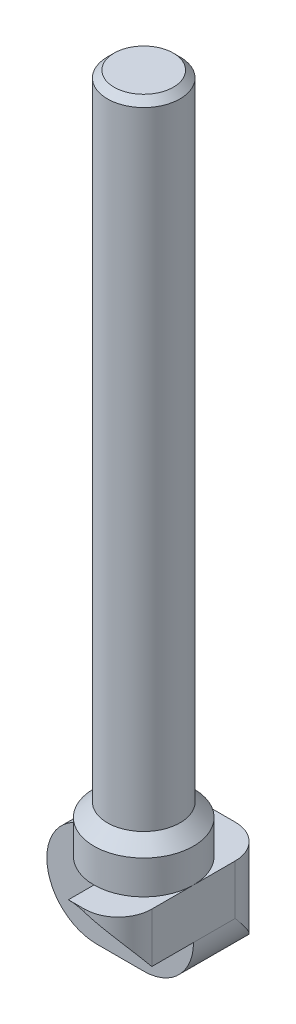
ISO-10303-21;
HEADER;
FILE_DESCRIPTION(('STEP AP214'),'2;1');
FILE_NAME('part.step','',(''),(''),'','','');
FILE_SCHEMA(('AUTOMOTIVE_DESIGN { 1 0 10303 214 1 1 1 1 }'));
ENDSEC;
DATA;
#1=APPLICATION_CONTEXT('core data for automotive mechanical design processes');
#2=APPLICATION_PROTOCOL_DEFINITION('international standard','automotive_design',2000,#1);
#3=PRODUCT_CONTEXT('',#1,'mechanical');
#4=PRODUCT('Part','Part','',(#3));
#5=PRODUCT_RELATED_PRODUCT_CATEGORY('part','',(#4));
#6=PRODUCT_DEFINITION_FORMATION('','',#4);
#7=PRODUCT_DEFINITION_CONTEXT('part definition',#1,'design');
#8=PRODUCT_DEFINITION('design','',#6,#7);
#9=PRODUCT_DEFINITION_SHAPE('','',#8);
#10=(LENGTH_UNIT() NAMED_UNIT(*) SI_UNIT(.MILLI.,.METRE.));
#11=(NAMED_UNIT(*) PLANE_ANGLE_UNIT() SI_UNIT($,.RADIAN.));
#12=(NAMED_UNIT(*) SI_UNIT($,.STERADIAN.) SOLID_ANGLE_UNIT());
#13=UNCERTAINTY_MEASURE_WITH_UNIT(LENGTH_MEASURE(1.E-05),#10,'distance_accuracy_value','');
#14=(GEOMETRIC_REPRESENTATION_CONTEXT(3) GLOBAL_UNCERTAINTY_ASSIGNED_CONTEXT((#13)) GLOBAL_UNIT_ASSIGNED_CONTEXT((#10,
#11,#12)) REPRESENTATION_CONTEXT('',''));
#15=CARTESIAN_POINT('',(0.,0.,0.));
#16=DIRECTION('',(0.,0.,1.));
#17=DIRECTION('',(1.,0.,0.));
#18=AXIS2_PLACEMENT_3D('',#15,#16,#17);
#19=CARTESIAN_POINT('',(-35.,-590.,-56.));
#20=DIRECTION('',(0.,0.,1.));
#21=DIRECTION('',(1.,0.,0.));
#22=AXIS2_PLACEMENT_3D('',#19,#20,#21);
#23=PLANE('',#22);
#24=DIRECTION('',(-1.,0.,0.));
#25=VECTOR('',#24,1.);
#26=CARTESIAN_POINT('',(37.0000000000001,-553.,-56.));
#27=LINE('',#26,#25);
#28=CARTESIAN_POINT('',(12.0000000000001,-553.,-56.));
#29=VERTEX_POINT('',#28);
#30=CARTESIAN_POINT('',(-35.,-553.,-56.));
#31=VERTEX_POINT('',#30);
#32=EDGE_CURVE('E258',#29,#31,#27,.T.);
#33=ORIENTED_EDGE('',*,*,#32,.F.);
#34=DIRECTION('',(0.,1.,0.));
#35=VECTOR('',#34,1.);
#36=CARTESIAN_POINT('',(12.0000000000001,-590.,-56.));
#37=LINE('',#36,#35);
#38=CARTESIAN_POINT('',(12.0000000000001,-625.,-56.));
#39=VERTEX_POINT('',#38);
#40=EDGE_CURVE('E55',#29,#39,#37,.F.);
#41=ORIENTED_EDGE('',*,*,#40,.T.);
#42=CARTESIAN_POINT('',(0.,-590.,-56.));
#43=DIRECTION('',(0.,0.,1.));
#44=DIRECTION('',(1.,0.,0.));
#45=AXIS2_PLACEMENT_3D('',#42,#43,#44);
#46=CIRCLE('',#45,37.);
#47=CARTESIAN_POINT('',(0.,-627.,-56.));
#48=VERTEX_POINT('',#47);
#49=EDGE_CURVE('E269',#48,#39,#46,.T.);
#50=ORIENTED_EDGE('',*,*,#49,.F.);
#51=DIRECTION('',(1.,0.,0.));
#52=VECTOR('',#51,1.);
#53=CARTESIAN_POINT('',(-35.,-627.,-56.));
#54=LINE('',#53,#52);
#55=CARTESIAN_POINT('',(-35.,-627.,-56.));
#56=VERTEX_POINT('',#55);
#57=EDGE_CURVE('E429',#56,#48,#54,.T.);
#58=ORIENTED_EDGE('',*,*,#57,.F.);
#59=CARTESIAN_POINT('',(-35.,-590.,-56.));
#60=DIRECTION('',(0.,0.,1.));
#61=DIRECTION('',(1.,0.,0.));
#62=AXIS2_PLACEMENT_3D('',#59,#60,#61);
#63=CIRCLE('',#62,37.);
#64=EDGE_CURVE('E137',#31,#56,#63,.T.);
#65=ORIENTED_EDGE('',*,*,#64,.F.);
#66=EDGE_LOOP('',(#33,#41,#50,#58,#65));
#67=FACE_BOUND('',#66,.T.);
#68=CARTESIAN_POINT('',(-35.,-590.,-56.));
#69=DIRECTION('',(0.,0.,1.));
#70=DIRECTION('',(1.,0.,0.));
#71=AXIS2_PLACEMENT_3D('',#68,#69,#70);
#72=CIRCLE('',#71,35.);
#73=CARTESIAN_POINT('',(0.,-590.,-56.));
#74=VERTEX_POINT('',#73);
#75=EDGE_CURVE('E11',#74,#74,#72,.F.);
#76=ORIENTED_EDGE('',*,*,#75,.F.);
#77=EDGE_LOOP('',(#76));
#78=FACE_BOUND('',#77,.T.);
#79=ADVANCED_FACE('F32',(#67,#78),#23,.F.);
#80=CARTESIAN_POINT('',(-35.,-590.,56.));
#81=DIRECTION('',(0.,0.,-1.));
#82=DIRECTION('',(-1.,0.,0.));
#83=AXIS2_PLACEMENT_3D('',#80,#81,#82);
#84=CYLINDRICAL_SURFACE('',#83,37.);
#85=CARTESIAN_POINT('',(-35.,-590.,0.));
#86=DIRECTION('',(0.,0.,1.));
#87=DIRECTION('',(1.,0.,0.));
#88=AXIS2_PLACEMENT_3D('',#85,#86,#87);
#89=CIRCLE('',#88,37.);
#90=CARTESIAN_POINT('',(-35.,-553.,0.));
#91=VERTEX_POINT('',#90);
#92=CARTESIAN_POINT('',(-35.,-627.,0.));
#93=VERTEX_POINT('',#92);
#94=EDGE_CURVE('E110',#91,#93,#89,.T.);
#95=ORIENTED_EDGE('',*,*,#94,.F.);
#96=DIRECTION('',(0.,0.,-1.));
#97=VECTOR('',#96,1.);
#98=CARTESIAN_POINT('',(-35.,-553.,56.));
#99=LINE('',#98,#97);
#100=CARTESIAN_POINT('',(-35.,-553.,-11.9999999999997));
#101=VERTEX_POINT('',#100);
#102=EDGE_CURVE('E251',#91,#101,#99,.T.);
#103=ORIENTED_EDGE('',*,*,#102,.T.);
#104=EDGE_CURVE('E254',#101,#31,#99,.T.);
#105=ORIENTED_EDGE('',*,*,#104,.T.);
#106=ORIENTED_EDGE('',*,*,#64,.T.);
#107=DIRECTION('',(0.,0.,-1.));
#108=VECTOR('',#107,1.);
#109=CARTESIAN_POINT('',(-35.,-627.,56.));
#110=LINE('',#109,#108);
#111=EDGE_CURVE('E128',#93,#56,#110,.T.);
#112=ORIENTED_EDGE('',*,*,#111,.F.);
#113=EDGE_LOOP('',(#95,#103,#105,#106,#112));
#114=FACE_BOUND('',#113,.T.);
#115=ADVANCED_FACE('F134',(#114),#84,.T.);
#116=CARTESIAN_POINT('',(-35.,-627.,56.));
#117=DIRECTION('',(0.,1.,0.));
#118=DIRECTION('',(0.,0.,1.));
#119=AXIS2_PLACEMENT_3D('',#116,#117,#118);
#120=PLANE('',#119);
#121=DIRECTION('',(1.,0.,0.));
#122=VECTOR('',#121,1.);
#123=CARTESIAN_POINT('',(-35.,-627.,0.));
#124=LINE('',#123,#122);
#125=CARTESIAN_POINT('',(0.,-627.,0.));
#126=VERTEX_POINT('',#125);
#127=EDGE_CURVE('E114',#93,#126,#124,.T.);
#128=ORIENTED_EDGE('',*,*,#127,.F.);
#129=ORIENTED_EDGE('',*,*,#111,.T.);
#130=ORIENTED_EDGE('',*,*,#57,.T.);
#131=DIRECTION('',(0.,0.,-1.));
#132=VECTOR('',#131,1.);
#133=CARTESIAN_POINT('',(0.,-627.,56.));
#134=LINE('',#133,#132);
#135=EDGE_CURVE('E130',#126,#48,#134,.T.);
#136=ORIENTED_EDGE('',*,*,#135,.F.);
#137=EDGE_LOOP('',(#128,#129,#130,#136));
#138=FACE_BOUND('',#137,.T.);
#139=ADVANCED_FACE('F126',(#138),#120,.F.);
#140=CARTESIAN_POINT('',(0.,-590.,56.));
#141=DIRECTION('',(0.,0.,-1.));
#142=DIRECTION('',(-1.,0.,0.));
#143=AXIS2_PLACEMENT_3D('',#140,#141,#142);
#144=CYLINDRICAL_SURFACE('',#143,37.);
#145=CARTESIAN_POINT('',(0.,-590.,0.));
#146=DIRECTION('',(0.,0.,1.));
#147=DIRECTION('',(-1.,0.,0.));
#148=AXIS2_PLACEMENT_3D('',#145,#146,#147);
#149=CIRCLE('',#148,36.9999999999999);
#150=CARTESIAN_POINT('',(37.0000000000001,-590.,0.));
#151=VERTEX_POINT('',#150);
#152=EDGE_CURVE('E424',#126,#151,#149,.T.);
#153=ORIENTED_EDGE('',*,*,#152,.F.);
#154=ORIENTED_EDGE('',*,*,#135,.T.);
#155=ORIENTED_EDGE('',*,*,#49,.T.);
#156=CARTESIAN_POINT('',(12.0000000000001,-625.,-56.));
#157=CARTESIAN_POINT('',(12.350024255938,-624.880004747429,-56.0000087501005));
#158=CARTESIAN_POINT('',(12.6982160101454,-624.754744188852,-55.9926493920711));
#159=CARTESIAN_POINT('',(13.3901199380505,-624.494073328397,-55.9637201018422));
#160=CARTESIAN_POINT('',(13.7338328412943,-624.358664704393,-55.9421525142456));
#161=CARTESIAN_POINT('',(14.4155751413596,-624.078246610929,-55.8853741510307));
#162=CARTESIAN_POINT('',(14.7536122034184,-623.933251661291,-55.8501836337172));
#163=CARTESIAN_POINT('',(15.4238605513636,-623.633901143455,-55.766737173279));
#164=CARTESIAN_POINT('',(15.7560716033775,-623.479545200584,-55.7184807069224));
#165=CARTESIAN_POINT('',(16.7364305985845,-623.006279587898,-55.5560956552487));
#166=CARTESIAN_POINT('',(17.3753705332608,-622.674256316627,-55.4237382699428));
#167=CARTESIAN_POINT('',(18.6248083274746,-621.978563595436,-55.1148619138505));
#168=CARTESIAN_POINT('',(19.235292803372,-621.614879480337,-54.938322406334));
#169=CARTESIAN_POINT('',(20.5584104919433,-620.77491028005,-54.5019399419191));
#170=CARTESIAN_POINT('',(21.2633816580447,-620.29162490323,-54.232297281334));
#171=CARTESIAN_POINT('',(22.6245312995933,-619.289001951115,-53.6422154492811));
#172=CARTESIAN_POINT('',(23.2807035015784,-618.76965975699,-53.3217697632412));
#173=CARTESIAN_POINT('',(24.545932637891,-617.698144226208,-52.6360670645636));
#174=CARTESIAN_POINT('',(25.1547874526,-617.145846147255,-52.2706333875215));
#175=CARTESIAN_POINT('',(26.3225144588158,-616.015111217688,-51.5025383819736));
#176=CARTESIAN_POINT('',(26.8813826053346,-615.43667225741,-51.0998740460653));
#177=CARTESIAN_POINT('',(28.155765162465,-614.03055189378,-50.1017060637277));
#178=CARTESIAN_POINT('',(28.8487096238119,-613.192680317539,-49.4916615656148));
#179=CARTESIAN_POINT('',(30.1431940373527,-611.483435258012,-48.2234147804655));
#180=CARTESIAN_POINT('',(30.7447005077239,-610.612049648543,-47.5651949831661));
#181=CARTESIAN_POINT('',(31.8601695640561,-608.842104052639,-46.2100155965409));
#182=CARTESIAN_POINT('',(32.3740369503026,-607.943515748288,-45.5130149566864));
#183=CARTESIAN_POINT('',(33.3166904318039,-606.125947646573,-44.0892177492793));
#184=CARTESIAN_POINT('',(33.7454811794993,-605.20696896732,-43.3624228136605));
#185=CARTESIAN_POINT('',(34.6177030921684,-603.122129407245,-41.701643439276));
#186=CARTESIAN_POINT('',(35.0381591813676,-601.951809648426,-40.761158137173));
#187=CARTESIAN_POINT('',(35.755830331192,-599.59374787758,-38.8548160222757));
#188=CARTESIAN_POINT('',(36.0529989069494,-598.405999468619,-37.8889497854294));
#189=CARTESIAN_POINT('',(36.5267596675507,-596.022397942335,-35.9435081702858));
#190=CARTESIAN_POINT('',(36.7036136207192,-594.826568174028,-34.9639673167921));
#191=CARTESIAN_POINT('',(36.9397072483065,-592.430241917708,-32.9976343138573));
#192=CARTESIAN_POINT('',(36.9990244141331,-591.229749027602,-32.0108473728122));
#193=CARTESIAN_POINT('',(36.999996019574,-590.019812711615,-31.0162859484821));
#194=CARTESIAN_POINT('',(36.9999999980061,-590.009906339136,-31.0081429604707));
#195=CARTESIAN_POINT('',(37.0000000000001,-590.,-31.));
#196=B_SPLINE_CURVE_WITH_KNOTS('',3,(#156,#157,#158,#159,#160,#161,#162,#163,#164,#165,#166,
#167,#168,#169,#170,#171,#172,#173,#174,#175,#176,#177,#178,#179,#180,#181,#182,#183,#184,#185,
#186,#187,#188,#189,#190,#191,#192,#193,#194,#195),.UNSPECIFIED.,.F.,.F.,(4,2,2,2,2,2,2,2,2,2,2,
2,2,2,2,2,2,2,2,4),(0.,1.10990953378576,2.21963595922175,3.3277184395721,4.43584530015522,
6.62917781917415,8.82353174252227,11.5082879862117,14.1933887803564,16.8893918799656,
19.5856129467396,23.3202782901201,27.0563078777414,30.7963703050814,34.5362281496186,
39.2079700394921,43.8814717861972,48.5447726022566,53.2049979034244,53.2434686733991),.UNSPECIFIED.);
#197=CARTESIAN_POINT('',(37.0000000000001,-590.,-31.));
#198=VERTEX_POINT('',#197);
#199=EDGE_CURVE('E170',#39,#198,#196,.T.);
#200=ORIENTED_EDGE('',*,*,#199,.T.);
#201=DIRECTION('',(0.,0.,-1.));
#202=VECTOR('',#201,1.);
#203=CARTESIAN_POINT('',(37.0000000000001,-590.,56.));
#204=LINE('',#203,#202);
#205=EDGE_CURVE('E263',#151,#198,#204,.T.);
#206=ORIENTED_EDGE('',*,*,#205,.F.);
#207=EDGE_LOOP('',(#153,#154,#155,#200,#206));
#208=FACE_BOUND('',#207,.T.);
#209=ADVANCED_FACE('F183',(#208),#144,.T.);
#210=CARTESIAN_POINT('',(-35.,-590.,56.));
#211=DIRECTION('',(0.,0.,1.));
#212=DIRECTION('',(1.,0.,0.));
#213=AXIS2_PLACEMENT_3D('',#210,#211,#212);
#214=PLANE('',#213);
#215=DIRECTION('',(-1.,0.,0.));
#216=VECTOR('',#215,1.);
#217=CARTESIAN_POINT('',(37.0000000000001,-553.,56.));
#218=LINE('',#217,#216);
#219=CARTESIAN_POINT('',(12.0000000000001,-553.,56.));
#220=VERTEX_POINT('',#219);
#221=CARTESIAN_POINT('',(0.,-553.,56.));
#222=VERTEX_POINT('',#221);
#223=EDGE_CURVE('E259',#220,#222,#218,.T.);
#224=ORIENTED_EDGE('',*,*,#223,.T.);
#225=CARTESIAN_POINT('',(0.,-590.,56.));
#226=DIRECTION('',(0.,0.,1.));
#227=DIRECTION('',(1.,0.,0.));
#228=AXIS2_PLACEMENT_3D('',#225,#226,#227);
#229=CIRCLE('',#228,37.);
#230=CARTESIAN_POINT('',(12.0000000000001,-555.,56.));
#231=VERTEX_POINT('',#230);
#232=EDGE_CURVE('E421',#231,#222,#229,.T.);
#233=ORIENTED_EDGE('',*,*,#232,.F.);
#234=DIRECTION('',(0.,1.,0.));
#235=VECTOR('',#234,1.);
#236=CARTESIAN_POINT('',(12.0000000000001,-553.,56.));
#237=LINE('',#236,#235);
#238=EDGE_CURVE('E159',#231,#220,#237,.T.);
#239=ORIENTED_EDGE('',*,*,#238,.T.);
#240=EDGE_LOOP('',(#224,#233,#239));
#241=FACE_BOUND('',#240,.T.);
#242=ADVANCED_FACE('F188',(#241),#214,.T.);
#243=CARTESIAN_POINT('',(12.0000000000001,-590.,31.));
#244=DIRECTION('',(0.,-1.,0.));
#245=DIRECTION('',(0.,0.,-1.));
#246=AXIS2_PLACEMENT_3D('',#243,#244,#245);
#247=CYLINDRICAL_SURFACE('',#246,25.);
#248=ORIENTED_EDGE('',*,*,#238,.F.);
#249=CARTESIAN_POINT('',(12.0000000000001,-555.,56.));
#250=CARTESIAN_POINT('',(12.3500242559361,-555.11999525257,56.0000087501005));
#251=CARTESIAN_POINT('',(12.6982160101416,-555.245255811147,55.9926493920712));
#252=CARTESIAN_POINT('',(13.3901199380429,-555.5059266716,55.9637201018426));
#253=CARTESIAN_POINT('',(13.7338328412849,-555.641335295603,55.9421525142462));
#254=CARTESIAN_POINT('',(14.4155751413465,-555.921753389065,55.885374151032));
#255=CARTESIAN_POINT('',(14.7536122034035,-556.066748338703,55.8501836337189));
#256=CARTESIAN_POINT('',(15.4238605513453,-556.366098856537,55.7667371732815));
#257=CARTESIAN_POINT('',(15.7560716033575,-556.520454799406,55.7184807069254));
#258=CARTESIAN_POINT('',(16.7364305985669,-556.993720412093,55.5560956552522));
#259=CARTESIAN_POINT('',(17.375370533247,-557.325743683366,55.4237382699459));
#260=CARTESIAN_POINT('',(18.6248083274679,-558.02143640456,55.1148619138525));
#261=CARTESIAN_POINT('',(19.2352928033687,-558.385120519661,54.9383224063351));
#262=CARTESIAN_POINT('',(20.5584104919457,-559.225089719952,54.5019399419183));
#263=CARTESIAN_POINT('',(21.2633816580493,-559.708375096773,54.2322972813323));
#264=CARTESIAN_POINT('',(22.6245312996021,-560.710998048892,53.642215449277));
#265=CARTESIAN_POINT('',(23.2807035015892,-561.230340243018,53.3217697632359));
#266=CARTESIAN_POINT('',(24.5459326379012,-562.301855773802,52.6360670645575));
#267=CARTESIAN_POINT('',(25.1547874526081,-562.854153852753,52.2706333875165));
#268=CARTESIAN_POINT('',(26.3225144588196,-563.984888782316,51.5025383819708));
#269=CARTESIAN_POINT('',(26.8813826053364,-564.563327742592,51.0998740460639));
#270=CARTESIAN_POINT('',(28.1557651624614,-565.969448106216,50.1017060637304));
#271=CARTESIAN_POINT('',(28.8487096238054,-566.807319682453,49.4916615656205));
#272=CARTESIAN_POINT('',(30.1431940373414,-568.516564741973,48.2234147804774));
#273=CARTESIAN_POINT('',(30.7447005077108,-569.387950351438,47.5651949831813));
#274=CARTESIAN_POINT('',(31.8601695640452,-571.157895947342,46.2100155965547));
#275=CARTESIAN_POINT('',(32.3740369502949,-572.056484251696,45.5130149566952));
#276=CARTESIAN_POINT('',(33.3166904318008,-573.874052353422,44.0892177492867));
#277=CARTESIAN_POINT('',(33.7454811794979,-574.793031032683,43.3624228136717));
#278=CARTESIAN_POINT('',(34.6177030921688,-576.877870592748,41.7016434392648));
#279=CARTESIAN_POINT('',(35.0381591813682,-578.048190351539,40.7611581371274));
#280=CARTESIAN_POINT('',(35.7558303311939,-580.406252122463,38.8548160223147));
#281=CARTESIAN_POINT('',(36.052998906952,-581.594000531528,37.8889497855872));
#282=CARTESIAN_POINT('',(36.5267596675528,-583.977602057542,35.9435081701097));
#283=CARTESIAN_POINT('',(36.7036136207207,-585.173431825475,34.9639673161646));
#284=CARTESIAN_POINT('',(36.9397072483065,-587.569758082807,32.9976343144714));
#285=CARTESIAN_POINT('',(36.9990244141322,-588.770250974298,32.0108473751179));
#286=CARTESIAN_POINT('',(36.9999960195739,-589.980187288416,31.0162859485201));
#287=CARTESIAN_POINT('',(36.9999999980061,-589.99009366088,31.0081429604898));
#288=CARTESIAN_POINT('',(37.,-590.,31.));
#289=B_SPLINE_CURVE_WITH_KNOTS('',3,(#249,#250,#251,#252,#253,#254,#255,#256,#257,#258,#259,
#260,#261,#262,#263,#264,#265,#266,#267,#268,#269,#270,#271,#272,#273,#274,#275,#276,#277,#278,
#279,#280,#281,#282,#283,#284,#285,#286,#287,#288),.UNSPECIFIED.,.F.,.F.,(4,2,2,2,2,2,2,2,2,2,2,
2,2,2,2,2,2,2,2,4),(0.,1.10990953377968,2.21963595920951,3.32771843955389,4.435845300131,
6.62917781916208,8.82353174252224,11.5082879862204,14.1933887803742,16.8893918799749,
19.5856129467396,23.3202782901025,27.0563078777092,30.7963703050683,34.5362281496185,
39.2079700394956,43.8814717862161,48.5447726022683,53.2049979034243,53.243468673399),.UNSPECIFIED.);
#290=CARTESIAN_POINT('',(37.0000000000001,-590.,31.));
#291=VERTEX_POINT('',#290);
#292=EDGE_CURVE('E41',#231,#291,#289,.T.);
#293=ORIENTED_EDGE('',*,*,#292,.T.);
#294=DIRECTION('',(0.,1.,0.));
#295=VECTOR('',#294,1.);
#296=CARTESIAN_POINT('',(37.0000000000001,-590.,31.));
#297=LINE('',#296,#295);
#298=CARTESIAN_POINT('',(37.0000000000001,-553.,31.));
#299=VERTEX_POINT('',#298);
#300=EDGE_CURVE('E167',#299,#291,#297,.F.);
#301=ORIENTED_EDGE('',*,*,#300,.F.);
#302=CARTESIAN_POINT('',(12.0000000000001,-553.,31.));
#303=DIRECTION('',(0.,-1.,0.));
#304=DIRECTION('',(0.,0.,-1.));
#305=AXIS2_PLACEMENT_3D('',#302,#303,#304);
#306=CIRCLE('',#305,25.);
#307=EDGE_CURVE('E162',#220,#299,#306,.F.);
#308=ORIENTED_EDGE('',*,*,#307,.F.);
#309=EDGE_LOOP('',(#248,#293,#301,#308));
#310=FACE_BOUND('',#309,.T.);
#311=ADVANCED_FACE('F218',(#310),#247,.T.);
#312=CARTESIAN_POINT('',(22.,-47.,0.));
#313=DIRECTION('',(0.,-1.,0.));
#314=DIRECTION('',(1.,0.,0.));
#315=AXIS2_PLACEMENT_3D('',#312,#313,#314);
#316=PLANE('',#315);
#317=CARTESIAN_POINT('',(0.,-47.,0.));
#318=DIRECTION('',(0.,1.,0.));
#319=DIRECTION('',(-1.,0.,0.));
#320=AXIS2_PLACEMENT_3D('',#317,#318,#319);
#321=CIRCLE('',#320,22.);
#322=CARTESIAN_POINT('',(-22.,-47.,0.));
#323=VERTEX_POINT('',#322);
#324=EDGE_CURVE('E138',#323,#323,#321,.T.);
#325=ORIENTED_EDGE('',*,*,#324,.T.);
#326=EDGE_LOOP('',(#325));
#327=FACE_BOUND('',#326,.T.);
#328=ADVANCED_FACE('F215',(#327),#316,.F.);
#329=CARTESIAN_POINT('',(37.0000000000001,-553.,0.));
#330=DIRECTION('',(0.,1.,0.));
#331=DIRECTION('',(-1.,0.,0.));
#332=AXIS2_PLACEMENT_3D('',#329,#330,#331);
#333=PLANE('',#332);
#334=CARTESIAN_POINT('',(0.,-553.,0.));
#335=DIRECTION('',(0.,1.,0.));
#336=DIRECTION('',(-1.,0.,0.));
#337=AXIS2_PLACEMENT_3D('',#334,#335,#336);
#338=CIRCLE('',#337,37.);
#339=CARTESIAN_POINT('',(0.,-553.,37.));
#340=VERTEX_POINT('',#339);
#341=EDGE_CURVE('E156',#101,#340,#338,.T.);
#342=ORIENTED_EDGE('',*,*,#341,.F.);
#343=ORIENTED_EDGE('',*,*,#102,.F.);
#344=DIRECTION('',(-1.,0.,0.));
#345=VECTOR('',#344,1.);
#346=CARTESIAN_POINT('',(0.,-553.,0.));
#347=LINE('',#346,#345);
#348=CARTESIAN_POINT('',(0.,-553.,0.));
#349=VERTEX_POINT('',#348);
#350=EDGE_CURVE('E118',#349,#91,#347,.T.);
#351=ORIENTED_EDGE('',*,*,#350,.F.);
#352=DIRECTION('',(0.,0.,-1.));
#353=VECTOR('',#352,1.);
#354=CARTESIAN_POINT('',(0.,-553.,56.));
#355=LINE('',#354,#353);
#356=EDGE_CURVE('E252',#340,#349,#355,.T.);
#357=ORIENTED_EDGE('',*,*,#356,.F.);
#358=EDGE_LOOP('',(#342,#343,#351,#357));
#359=FACE_BOUND('',#358,.T.);
#360=ADVANCED_FACE('F212',(#359),#333,.F.);
#361=CARTESIAN_POINT('',(0.,22.74636757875,0.));
#362=DIRECTION('',(0.,1.,0.));
#363=DIRECTION('',(-1.,0.,0.));
#364=AXIS2_PLACEMENT_3D('',#361,#362,#363);
#365=CYLINDRICAL_SURFACE('',#364,37.);
#366=CARTESIAN_POINT('',(0.,-528.,0.));
#367=DIRECTION('',(0.,1.,0.));
#368=DIRECTION('',(-1.,0.,0.));
#369=AXIS2_PLACEMENT_3D('',#366,#367,#368);
#370=CIRCLE('',#369,37.);
#371=CARTESIAN_POINT('',(-36.9999999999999,-528.,0.));
#372=VERTEX_POINT('',#371);
#373=EDGE_CURVE('E152',#372,#372,#370,.T.);
#374=ORIENTED_EDGE('',*,*,#373,.F.);
#375=EDGE_LOOP('',(#374));
#376=FACE_BOUND('',#375,.T.);
#377=ORIENTED_EDGE('',*,*,#341,.T.);
#378=CARTESIAN_POINT('',(37.0000000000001,-553.,0.));
#379=VERTEX_POINT('',#378);
#380=EDGE_CURVE('E160',#340,#379,#338,.T.);
#381=ORIENTED_EDGE('',*,*,#380,.T.);
#382=EDGE_CURVE('E155',#379,#101,#338,.T.);
#383=ORIENTED_EDGE('',*,*,#382,.T.);
#384=EDGE_LOOP('',(#377,#381,#383));
#385=FACE_BOUND('',#384,.T.);
#386=ADVANCED_FACE('F208',(#376,#385),#365,.T.);
#387=CARTESIAN_POINT('',(0.,-528.,0.));
#388=DIRECTION('',(0.,-1.,0.));
#389=DIRECTION('',(1.,0.,0.));
#390=AXIS2_PLACEMENT_3D('',#387,#388,#389);
#391=CONICAL_SURFACE('',#390,37.,0.785398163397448);
#392=CARTESIAN_POINT('',(0.,-518.,0.));
#393=DIRECTION('',(0.,1.,0.));
#394=DIRECTION('',(-1.,0.,0.));
#395=AXIS2_PLACEMENT_3D('',#392,#393,#394);
#396=CIRCLE('',#395,27.);
#397=CARTESIAN_POINT('',(-26.9999999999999,-518.,0.));
#398=VERTEX_POINT('',#397);
#399=EDGE_CURVE('E149',#398,#398,#396,.T.);
#400=ORIENTED_EDGE('',*,*,#399,.F.);
#401=EDGE_LOOP('',(#400));
#402=FACE_BOUND('',#401,.T.);
#403=ORIENTED_EDGE('',*,*,#373,.T.);
#404=EDGE_LOOP('',(#403));
#405=FACE_BOUND('',#404,.T.);
#406=ADVANCED_FACE('F204',(#402,#405),#391,.T.);
#407=CARTESIAN_POINT('',(0.,22.74636757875,0.));
#408=DIRECTION('',(0.,1.,0.));
#409=DIRECTION('',(-1.,0.,0.));
#410=AXIS2_PLACEMENT_3D('',#407,#408,#409);
#411=CYLINDRICAL_SURFACE('',#410,27.);
#412=CARTESIAN_POINT('',(0.,-52.,0.));
#413=DIRECTION('',(0.,1.,0.));
#414=DIRECTION('',(-1.,0.,0.));
#415=AXIS2_PLACEMENT_3D('',#412,#413,#414);
#416=CIRCLE('',#415,27.);
#417=CARTESIAN_POINT('',(-27.,-52.,0.));
#418=VERTEX_POINT('',#417);
#419=EDGE_CURVE('E141',#418,#418,#416,.T.);
#420=ORIENTED_EDGE('',*,*,#419,.F.);
#421=EDGE_LOOP('',(#420));
#422=FACE_BOUND('',#421,.T.);
#423=ORIENTED_EDGE('',*,*,#399,.T.);
#424=EDGE_LOOP('',(#423));
#425=FACE_BOUND('',#424,.T.);
#426=ADVANCED_FACE('F200',(#422,#425),#411,.T.);
#427=CARTESIAN_POINT('',(0.,-52.,0.));
#428=DIRECTION('',(0.,-1.,0.));
#429=DIRECTION('',(1.,0.,0.));
#430=AXIS2_PLACEMENT_3D('',#427,#428,#429);
#431=CONICAL_SURFACE('',#430,27.,0.785398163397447);
#432=ORIENTED_EDGE('',*,*,#324,.F.);
#433=EDGE_LOOP('',(#432));
#434=FACE_BOUND('',#433,.T.);
#435=ORIENTED_EDGE('',*,*,#419,.T.);
#436=EDGE_LOOP('',(#435));
#437=FACE_BOUND('',#436,.T.);
#438=ADVANCED_FACE('F196',(#434,#437),#431,.T.);
#439=CARTESIAN_POINT('',(37.0000000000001,-553.,56.));
#440=DIRECTION('',(0.,-1.,0.));
#441=DIRECTION('',(0.,0.,-1.));
#442=AXIS2_PLACEMENT_3D('',#439,#440,#441);
#443=PLANE('',#442);
#444=ORIENTED_EDGE('',*,*,#380,.F.);
#445=EDGE_CURVE('E244',#222,#340,#355,.T.);
#446=ORIENTED_EDGE('',*,*,#445,.F.);
#447=ORIENTED_EDGE('',*,*,#223,.F.);
#448=ORIENTED_EDGE('',*,*,#307,.T.);
#449=DIRECTION('',(0.,0.,-1.));
#450=VECTOR('',#449,1.);
#451=CARTESIAN_POINT('',(37.0000000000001,-553.,56.));
#452=LINE('',#451,#450);
#453=EDGE_CURVE('E247',#299,#379,#452,.T.);
#454=ORIENTED_EDGE('',*,*,#453,.T.);
#455=EDGE_LOOP('',(#444,#446,#447,#448,#454));
#456=FACE_BOUND('',#455,.T.);
#457=ADVANCED_FACE('F199',(#456),#443,.F.);
#458=CARTESIAN_POINT('',(37.0000000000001,-553.,-31.));
#459=VERTEX_POINT('',#458);
#460=EDGE_CURVE('E255',#379,#459,#452,.T.);
#461=ORIENTED_EDGE('',*,*,#460,.T.);
#462=CARTESIAN_POINT('',(12.0000000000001,-553.,-31.));
#463=DIRECTION('',(0.,-1.,0.));
#464=DIRECTION('',(0.,0.,-1.));
#465=AXIS2_PLACEMENT_3D('',#462,#463,#464);
#466=CIRCLE('',#465,25.);
#467=EDGE_CURVE('E48',#459,#29,#466,.F.);
#468=ORIENTED_EDGE('',*,*,#467,.T.);
#469=ORIENTED_EDGE('',*,*,#32,.T.);
#470=ORIENTED_EDGE('',*,*,#104,.F.);
#471=ORIENTED_EDGE('',*,*,#382,.F.);
#472=EDGE_LOOP('',(#461,#468,#469,#470,#471));
#473=FACE_BOUND('',#472,.T.);
#474=ADVANCED_FACE('F234',(#473),#443,.F.);
#475=CARTESIAN_POINT('',(37.0000000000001,-553.,56.));
#476=DIRECTION('',(-1.,0.,0.));
#477=DIRECTION('',(0.,0.,1.));
#478=AXIS2_PLACEMENT_3D('',#475,#476,#477);
#479=PLANE('',#478);
#480=ORIENTED_EDGE('',*,*,#453,.F.);
#481=ORIENTED_EDGE('',*,*,#300,.T.);
#482=EDGE_CURVE('E143',#291,#151,#204,.T.);
#483=ORIENTED_EDGE('',*,*,#482,.T.);
#484=ORIENTED_EDGE('',*,*,#205,.T.);
#485=DIRECTION('',(0.,1.,0.));
#486=VECTOR('',#485,1.);
#487=CARTESIAN_POINT('',(37.0000000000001,-553.,-31.));
#488=LINE('',#487,#486);
#489=EDGE_CURVE('E164',#198,#459,#488,.T.);
#490=ORIENTED_EDGE('',*,*,#489,.T.);
#491=ORIENTED_EDGE('',*,*,#460,.F.);
#492=EDGE_LOOP('',(#480,#481,#483,#484,#490,#491));
#493=FACE_BOUND('',#492,.T.);
#494=ADVANCED_FACE('F190',(#493),#479,.F.);
#495=CARTESIAN_POINT('',(12.0000000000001,-553.,-31.));
#496=DIRECTION('',(0.,1.,0.));
#497=DIRECTION('',(0.,0.,1.));
#498=AXIS2_PLACEMENT_3D('',#495,#496,#497);
#499=CYLINDRICAL_SURFACE('',#498,25.);
#500=ORIENTED_EDGE('',*,*,#199,.F.);
#501=ORIENTED_EDGE('',*,*,#40,.F.);
#502=ORIENTED_EDGE('',*,*,#467,.F.);
#503=ORIENTED_EDGE('',*,*,#489,.F.);
#504=EDGE_LOOP('',(#500,#501,#502,#503));
#505=FACE_BOUND('',#504,.T.);
#506=ADVANCED_FACE('F179',(#505),#499,.T.);
#507=CARTESIAN_POINT('',(0.,-590.,56.));
#508=DIRECTION('',(0.,0.,-1.));
#509=DIRECTION('',(-1.,0.,0.));
#510=AXIS2_PLACEMENT_3D('',#507,#508,#509);
#511=CYLINDRICAL_SURFACE('',#510,36.9999999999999);
#512=ORIENTED_EDGE('',*,*,#482,.F.);
#513=ORIENTED_EDGE('',*,*,#292,.F.);
#514=ORIENTED_EDGE('',*,*,#232,.T.);
#515=ORIENTED_EDGE('',*,*,#445,.T.);
#516=ORIENTED_EDGE('',*,*,#356,.T.);
#517=EDGE_CURVE('E131',#151,#349,#149,.T.);
#518=ORIENTED_EDGE('',*,*,#517,.F.);
#519=EDGE_LOOP('',(#512,#513,#514,#515,#516,#518));
#520=FACE_BOUND('',#519,.T.);
#521=ADVANCED_FACE('F276',(#520),#511,.F.);
#522=CARTESIAN_POINT('',(-35.,-590.,0.));
#523=DIRECTION('',(0.,0.,1.));
#524=DIRECTION('',(1.,0.,0.));
#525=AXIS2_PLACEMENT_3D('',#522,#523,#524);
#526=PLANE('',#525);
#527=ORIENTED_EDGE('',*,*,#94,.T.);
#528=ORIENTED_EDGE('',*,*,#127,.T.);
#529=ORIENTED_EDGE('',*,*,#152,.T.);
#530=ORIENTED_EDGE('',*,*,#517,.T.);
#531=ORIENTED_EDGE('',*,*,#350,.T.);
#532=EDGE_LOOP('',(#527,#528,#529,#530,#531));
#533=FACE_BOUND('',#532,.T.);
#534=ADVANCED_FACE('F112',(#533),#526,.T.);
#535=CARTESIAN_POINT('',(-35.,-590.,-58.));
#536=DIRECTION('',(0.,0.,1.));
#537=DIRECTION('',(1.,0.,0.));
#538=AXIS2_PLACEMENT_3D('',#535,#536,#537);
#539=CYLINDRICAL_SURFACE('',#538,35.);
#540=CARTESIAN_POINT('',(-35.,-590.,-58.));
#541=DIRECTION('',(0.,0.,-1.));
#542=DIRECTION('',(-1.,0.,0.));
#543=AXIS2_PLACEMENT_3D('',#540,#541,#542);
#544=CIRCLE('',#543,35.);
#545=CARTESIAN_POINT('',(-70.,-590.,-58.));
#546=VERTEX_POINT('',#545);
#547=EDGE_CURVE('E36',#546,#546,#544,.T.);
#548=ORIENTED_EDGE('',*,*,#547,.F.);
#549=EDGE_LOOP('',(#548));
#550=FACE_BOUND('',#549,.T.);
#551=ORIENTED_EDGE('',*,*,#75,.T.);
#552=EDGE_LOOP('',(#551));
#553=FACE_BOUND('',#552,.T.);
#554=ADVANCED_FACE('F283',(#550,#553),#539,.T.);
#555=CARTESIAN_POINT('',(-35.,-590.,144.666666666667));
#556=DIRECTION('',(0.,0.,1.));
#557=DIRECTION('',(1.,0.,0.));
#558=AXIS2_PLACEMENT_3D('',#555,#556,#557);
#559=SPHERICAL_SURFACE('',#558,205.666666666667);
#560=ORIENTED_EDGE('',*,*,#547,.T.);
#561=EDGE_LOOP('',(#560));
#562=FACE_BOUND('',#561,.T.);
#563=ADVANCED_FACE('F34',(#562),#559,.T.);
#564=CLOSED_SHELL('',(#79,#115,#139,#209,#242,#311,#328,#360,#386,#406,#426,#438,#457,#474,#494,
#506,#521,#534,#554,#563));
#565=MANIFOLD_SOLID_BREP('B2',#564);
#566=ADVANCED_BREP_SHAPE_REPRESENTATION('',(#18,#565),#14);
#567=SHAPE_DEFINITION_REPRESENTATION(#9,#566);
ENDSEC;
END-ISO-10303-21;
